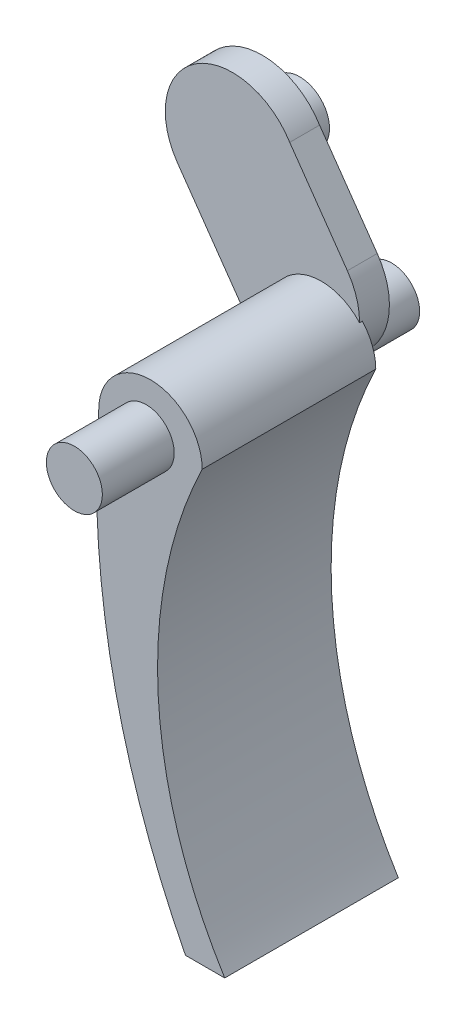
from build123d import *

# Parameters (mm, degrees)
SKETCH_1_R        = 1.5
EXTRUDE_263_DEPTH = 8.5
EXTRUDE_499_DEPTH = 4.65
EXTRUDE_2_DEPTH   = 1.6
SKETCH_4_R        = 1.6
EXTRUDE_3_DEPTH   = 2


with BuildPart() as part:
    # Sketch 1 → Extrude 263 (new, symmetric)
    with BuildSketch(Plane.XY):
        Circle(SKETCH_1_R)
    extrude(amount=EXTRUDE_263_DEPTH, both=True)



with BuildPart() as body_2:
    # Sketch 2 → Extrude 499 (new, symmetric)
    with BuildSketch(Plane.XY):
        with BuildLine():
            Line((2.103356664, -23), (4.206713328, -23))
            ThreePointArc((4.206713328, -23), (0.640851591, -11.655430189), (3, 0))
            ThreePointArc((3, 0), (0.228356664, 2.771643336), (-2.543286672, 0))
            ThreePointArc((-2.543286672, 0), (-1.80745886, -11.820718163), (2.103356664, -23))
        make_face()
    extrude(amount=EXTRUDE_499_DEPTH, both=True)


with BuildPart() as part_1:
    add(part.part)

    add(body_2.part)  # Extrude 2 merges body 2
    # Sketch 3 → Extrude 2 (add)
    with BuildSketch(Plane(origin=(0, 0, -4.5), x_dir=(-1, 0, 0), z_dir=(0, 0, -1))):
        with BuildLine():
            Line((-1.628823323, 3.952937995), (1.460361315, 8.364750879))
            ThreePointArc((1.460361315, 8.364750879), (6.50511646, 9.486338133), (7.47746359, 4.410704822))
            Line((7.47746359, 4.410704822), (4.388278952, -0.001108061))
            ThreePointArc((4.388278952, -0.001108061), (-0.656476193, -1.122695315), (-1.628823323, 3.952937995))
        make_face()
    extrude(amount=EXTRUDE_2_DEPTH)

    # Sketch 4 → Extrude 3 (add)
    with BuildSketch(Plane(origin=(0, 0, -6.1), x_dir=(-1, 0, 0), z_dir=(0, 0, -1))):
        with Locations((4.527233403, 6.476478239)):
            Circle(SKETCH_4_R)
    extrude(amount=EXTRUDE_3_DEPTH)


solid = part_1.part
